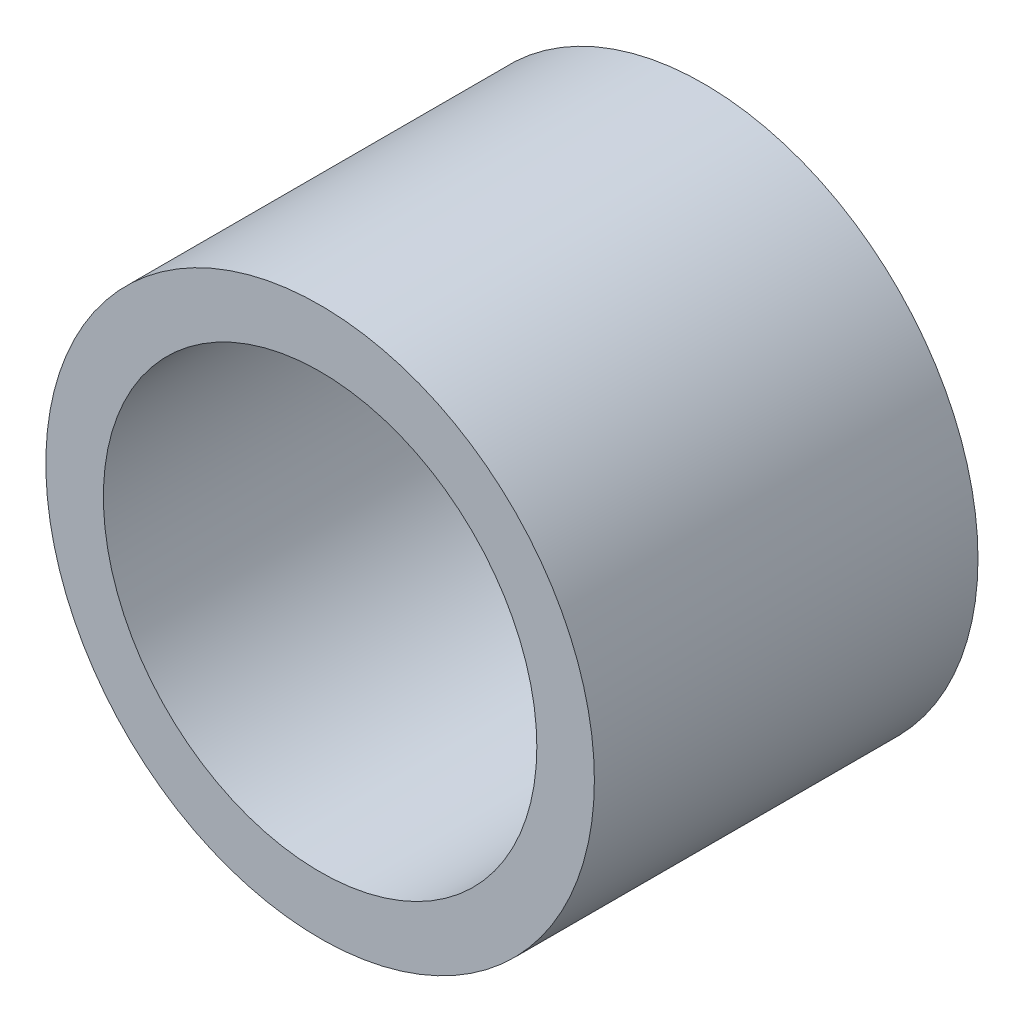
ISO-10303-21;
HEADER;
FILE_DESCRIPTION(('STEP AP214'),'2;1');
FILE_NAME('part.step','',(''),(''),'','','');
FILE_SCHEMA(('AUTOMOTIVE_DESIGN { 1 0 10303 214 1 1 1 1 }'));
ENDSEC;
DATA;
#1=APPLICATION_CONTEXT('core data for automotive mechanical design processes');
#2=APPLICATION_PROTOCOL_DEFINITION('international standard','automotive_design',2000,#1);
#3=PRODUCT_CONTEXT('',#1,'mechanical');
#4=PRODUCT('Part','Part','',(#3));
#5=PRODUCT_RELATED_PRODUCT_CATEGORY('part','',(#4));
#6=PRODUCT_DEFINITION_FORMATION('','',#4);
#7=PRODUCT_DEFINITION_CONTEXT('part definition',#1,'design');
#8=PRODUCT_DEFINITION('design','',#6,#7);
#9=PRODUCT_DEFINITION_SHAPE('','',#8);
#10=(LENGTH_UNIT() NAMED_UNIT(*) SI_UNIT(.MILLI.,.METRE.));
#11=(NAMED_UNIT(*) PLANE_ANGLE_UNIT() SI_UNIT($,.RADIAN.));
#12=(NAMED_UNIT(*) SI_UNIT($,.STERADIAN.) SOLID_ANGLE_UNIT());
#13=UNCERTAINTY_MEASURE_WITH_UNIT(LENGTH_MEASURE(1.E-05),#10,'distance_accuracy_value','');
#14=(GEOMETRIC_REPRESENTATION_CONTEXT(3) GLOBAL_UNCERTAINTY_ASSIGNED_CONTEXT((#13)) GLOBAL_UNIT_ASSIGNED_CONTEXT((#10,
#11,#12)) REPRESENTATION_CONTEXT('',''));
#15=CARTESIAN_POINT('',(0.,0.,0.));
#16=DIRECTION('',(0.,0.,1.));
#17=DIRECTION('',(1.,0.,0.));
#18=AXIS2_PLACEMENT_3D('',#15,#16,#17);
#19=CARTESIAN_POINT('',(0.,0.,10.));
#20=DIRECTION('',(0.,0.,1.));
#21=DIRECTION('',(1.,0.,0.));
#22=AXIS2_PLACEMENT_3D('',#19,#20,#21);
#23=PLANE('',#22);
#24=CARTESIAN_POINT('',(0.,0.,10.));
#25=DIRECTION('',(0.,0.,1.));
#26=DIRECTION('',(1.,0.,0.));
#27=AXIS2_PLACEMENT_3D('',#24,#25,#26);
#28=CIRCLE('',#27,7.15);
#29=CARTESIAN_POINT('',(7.15,0.,10.));
#30=VERTEX_POINT('',#29);
#31=EDGE_CURVE('E10',#30,#30,#28,.T.);
#32=ORIENTED_EDGE('',*,*,#31,.T.);
#33=EDGE_LOOP('',(#32));
#34=FACE_BOUND('',#33,.T.);
#35=CARTESIAN_POINT('',(0.,0.,10.));
#36=DIRECTION('',(0.,0.,1.));
#37=DIRECTION('',(1.,0.,0.));
#38=AXIS2_PLACEMENT_3D('',#35,#36,#37);
#39=CIRCLE('',#38,5.65);
#40=CARTESIAN_POINT('',(5.65,0.,10.));
#41=VERTEX_POINT('',#40);
#42=EDGE_CURVE('E40',#41,#41,#39,.T.);
#43=ORIENTED_EDGE('',*,*,#42,.F.);
#44=EDGE_LOOP('',(#43));
#45=FACE_BOUND('',#44,.T.);
#46=ADVANCED_FACE('F29',(#34,#45),#23,.T.);
#47=CARTESIAN_POINT('',(0.,0.,0.));
#48=DIRECTION('',(0.,0.,1.));
#49=DIRECTION('',(1.,0.,0.));
#50=AXIS2_PLACEMENT_3D('',#47,#48,#49);
#51=PLANE('',#50);
#52=CARTESIAN_POINT('',(0.,0.,0.));
#53=DIRECTION('',(0.,0.,1.));
#54=DIRECTION('',(1.,0.,0.));
#55=AXIS2_PLACEMENT_3D('',#52,#53,#54);
#56=CIRCLE('',#55,7.15);
#57=CARTESIAN_POINT('',(7.15,0.,0.));
#58=VERTEX_POINT('',#57);
#59=EDGE_CURVE('E33',#58,#58,#56,.T.);
#60=ORIENTED_EDGE('',*,*,#59,.F.);
#61=EDGE_LOOP('',(#60));
#62=FACE_BOUND('',#61,.T.);
#63=CARTESIAN_POINT('',(0.,0.,0.));
#64=DIRECTION('',(0.,0.,1.));
#65=DIRECTION('',(1.,0.,0.));
#66=AXIS2_PLACEMENT_3D('',#63,#64,#65);
#67=CIRCLE('',#66,5.65);
#68=CARTESIAN_POINT('',(5.65,0.,0.));
#69=VERTEX_POINT('',#68);
#70=EDGE_CURVE('E42',#69,#69,#67,.T.);
#71=ORIENTED_EDGE('',*,*,#70,.T.);
#72=EDGE_LOOP('',(#71));
#73=FACE_BOUND('',#72,.T.);
#74=ADVANCED_FACE('F52',(#62,#73),#51,.F.);
#75=CARTESIAN_POINT('',(0.,0.,10.));
#76=DIRECTION('',(0.,0.,-1.));
#77=DIRECTION('',(-1.,0.,0.));
#78=AXIS2_PLACEMENT_3D('',#75,#76,#77);
#79=CYLINDRICAL_SURFACE('',#78,7.15);
#80=ORIENTED_EDGE('',*,*,#31,.F.);
#81=EDGE_LOOP('',(#80));
#82=FACE_BOUND('',#81,.T.);
#83=ORIENTED_EDGE('',*,*,#59,.T.);
#84=EDGE_LOOP('',(#83));
#85=FACE_BOUND('',#84,.T.);
#86=ADVANCED_FACE('F31',(#82,#85),#79,.T.);
#87=CARTESIAN_POINT('',(0.,0.,10.));
#88=DIRECTION('',(0.,0.,-1.));
#89=DIRECTION('',(-1.,0.,0.));
#90=AXIS2_PLACEMENT_3D('',#87,#88,#89);
#91=CYLINDRICAL_SURFACE('',#90,5.65);
#92=ORIENTED_EDGE('',*,*,#42,.T.);
#93=EDGE_LOOP('',(#92));
#94=FACE_BOUND('',#93,.T.);
#95=ORIENTED_EDGE('',*,*,#70,.F.);
#96=EDGE_LOOP('',(#95));
#97=FACE_BOUND('',#96,.T.);
#98=ADVANCED_FACE('F48',(#94,#97),#91,.F.);
#99=CLOSED_SHELL('',(#46,#74,#86,#98));
#100=MANIFOLD_SOLID_BREP('B2',#99);
#101=ADVANCED_BREP_SHAPE_REPRESENTATION('',(#18,#100),#14);
#102=SHAPE_DEFINITION_REPRESENTATION(#9,#101);
ENDSEC;
END-ISO-10303-21;
